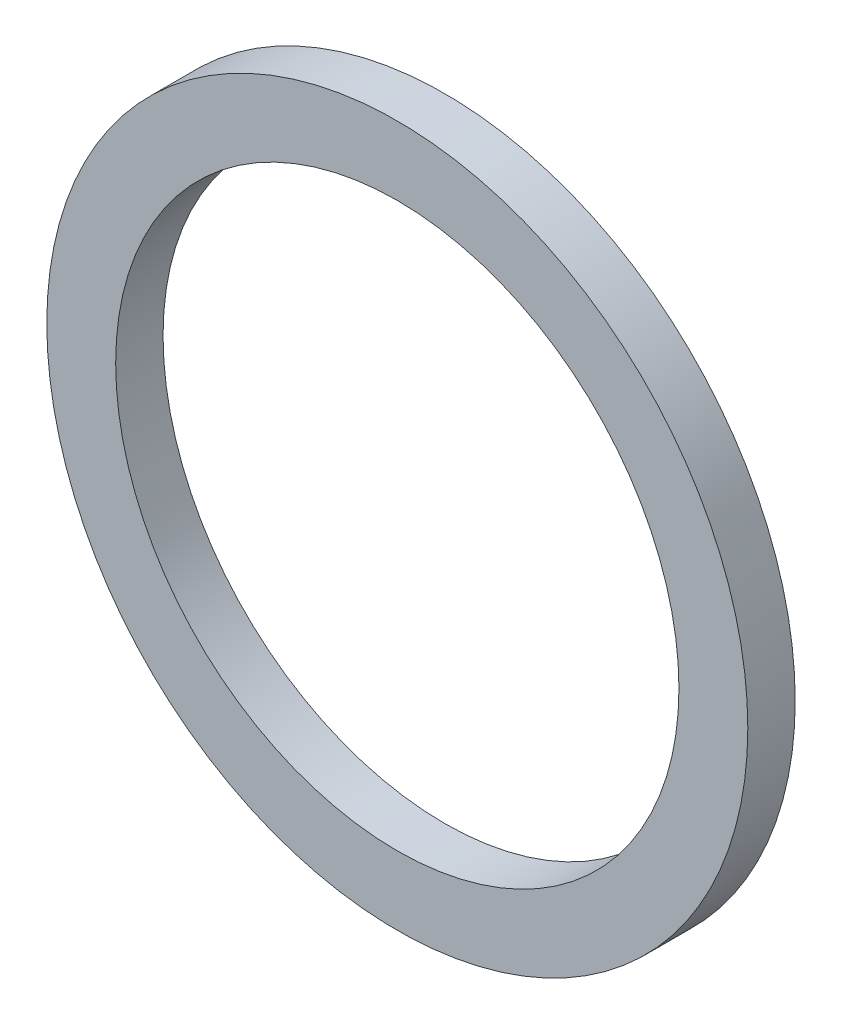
ISO-10303-21;
HEADER;
FILE_DESCRIPTION(('STEP AP214'),'2;1');
FILE_NAME('part.step','',(''),(''),'','','');
FILE_SCHEMA(('AUTOMOTIVE_DESIGN { 1 0 10303 214 1 1 1 1 }'));
ENDSEC;
DATA;
#1=APPLICATION_CONTEXT('core data for automotive mechanical design processes');
#2=APPLICATION_PROTOCOL_DEFINITION('international standard','automotive_design',2000,#1);
#3=PRODUCT_CONTEXT('',#1,'mechanical');
#4=PRODUCT('Part','Part','',(#3));
#5=PRODUCT_RELATED_PRODUCT_CATEGORY('part','',(#4));
#6=PRODUCT_DEFINITION_FORMATION('','',#4);
#7=PRODUCT_DEFINITION_CONTEXT('part definition',#1,'design');
#8=PRODUCT_DEFINITION('design','',#6,#7);
#9=PRODUCT_DEFINITION_SHAPE('','',#8);
#10=(LENGTH_UNIT() NAMED_UNIT(*) SI_UNIT(.MILLI.,.METRE.));
#11=(NAMED_UNIT(*) PLANE_ANGLE_UNIT() SI_UNIT($,.RADIAN.));
#12=(NAMED_UNIT(*) SI_UNIT($,.STERADIAN.) SOLID_ANGLE_UNIT());
#13=UNCERTAINTY_MEASURE_WITH_UNIT(LENGTH_MEASURE(1.E-05),#10,'distance_accuracy_value','');
#14=(GEOMETRIC_REPRESENTATION_CONTEXT(3) GLOBAL_UNCERTAINTY_ASSIGNED_CONTEXT((#13)) GLOBAL_UNIT_ASSIGNED_CONTEXT((#10,
#11,#12)) REPRESENTATION_CONTEXT('',''));
#15=CARTESIAN_POINT('',(0.,0.,0.));
#16=DIRECTION('',(0.,0.,1.));
#17=DIRECTION('',(1.,0.,0.));
#18=AXIS2_PLACEMENT_3D('',#15,#16,#17);
#19=CARTESIAN_POINT('',(0.,0.,1.49999999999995));
#20=DIRECTION('',(0.,0.,1.));
#21=DIRECTION('',(1.,0.,0.));
#22=AXIS2_PLACEMENT_3D('',#19,#20,#21);
#23=PLANE('',#22);
#24=CARTESIAN_POINT('',(0.,0.,1.49999999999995));
#25=DIRECTION('',(0.,0.,1.));
#26=DIRECTION('',(1.,0.,0.));
#27=AXIS2_PLACEMENT_3D('',#24,#25,#26);
#28=CIRCLE('',#27,11.095);
#29=CARTESIAN_POINT('',(11.095,0.,1.49999999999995));
#30=VERTEX_POINT('',#29);
#31=EDGE_CURVE('E10',#30,#30,#28,.T.);
#32=ORIENTED_EDGE('',*,*,#31,.T.);
#33=EDGE_LOOP('',(#32));
#34=FACE_BOUND('',#33,.T.);
#35=CARTESIAN_POINT('',(0.,0.,1.49999999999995));
#36=DIRECTION('',(0.,0.,1.));
#37=DIRECTION('',(1.,0.,0.));
#38=AXIS2_PLACEMENT_3D('',#35,#36,#37);
#39=CIRCLE('',#38,8.915);
#40=CARTESIAN_POINT('',(8.91500000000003,0.,1.49999999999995));
#41=VERTEX_POINT('',#40);
#42=EDGE_CURVE('E47',#41,#41,#39,.T.);
#43=ORIENTED_EDGE('',*,*,#42,.F.);
#44=EDGE_LOOP('',(#43));
#45=FACE_BOUND('',#44,.T.);
#46=ADVANCED_FACE('F36',(#34,#45),#23,.T.);
#47=CARTESIAN_POINT('',(0.,0.,0.));
#48=DIRECTION('',(0.,0.,1.));
#49=DIRECTION('',(1.,0.,0.));
#50=AXIS2_PLACEMENT_3D('',#47,#48,#49);
#51=PLANE('',#50);
#52=CARTESIAN_POINT('',(0.,0.,0.));
#53=DIRECTION('',(0.,0.,1.));
#54=DIRECTION('',(1.,0.,0.));
#55=AXIS2_PLACEMENT_3D('',#52,#53,#54);
#56=CIRCLE('',#55,11.095);
#57=CARTESIAN_POINT('',(11.095,0.,0.));
#58=VERTEX_POINT('',#57);
#59=EDGE_CURVE('E43',#58,#58,#56,.T.);
#60=ORIENTED_EDGE('',*,*,#59,.F.);
#61=EDGE_LOOP('',(#60));
#62=FACE_BOUND('',#61,.T.);
#63=CARTESIAN_POINT('',(0.,0.,0.));
#64=DIRECTION('',(0.,0.,1.));
#65=DIRECTION('',(1.,0.,0.));
#66=AXIS2_PLACEMENT_3D('',#63,#64,#65);
#67=CIRCLE('',#66,8.915);
#68=CARTESIAN_POINT('',(8.915,0.,0.));
#69=VERTEX_POINT('',#68);
#70=EDGE_CURVE('E51',#69,#69,#67,.T.);
#71=ORIENTED_EDGE('',*,*,#70,.T.);
#72=EDGE_LOOP('',(#71));
#73=FACE_BOUND('',#72,.T.);
#74=ADVANCED_FACE('F57',(#62,#73),#51,.F.);
#75=CARTESIAN_POINT('',(0.,0.,1.49999999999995));
#76=DIRECTION('',(0.,0.,-1.));
#77=DIRECTION('',(-1.,0.,0.));
#78=AXIS2_PLACEMENT_3D('',#75,#76,#77);
#79=CYLINDRICAL_SURFACE('',#78,11.095);
#80=ORIENTED_EDGE('',*,*,#31,.F.);
#81=EDGE_LOOP('',(#80));
#82=FACE_BOUND('',#81,.T.);
#83=ORIENTED_EDGE('',*,*,#59,.T.);
#84=EDGE_LOOP('',(#83));
#85=FACE_BOUND('',#84,.T.);
#86=ADVANCED_FACE('F38',(#82,#85),#79,.T.);
#87=CARTESIAN_POINT('',(0.,0.,1.49999999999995));
#88=DIRECTION('',(0.,0.,-1.));
#89=DIRECTION('',(-1.,0.,0.));
#90=AXIS2_PLACEMENT_3D('',#87,#88,#89);
#91=CYLINDRICAL_SURFACE('',#90,8.915);
#92=ORIENTED_EDGE('',*,*,#42,.T.);
#93=EDGE_LOOP('',(#92));
#94=FACE_BOUND('',#93,.T.);
#95=ORIENTED_EDGE('',*,*,#70,.F.);
#96=EDGE_LOOP('',(#95));
#97=FACE_BOUND('',#96,.T.);
#98=ADVANCED_FACE('F59',(#94,#97),#91,.F.);
#99=CLOSED_SHELL('',(#46,#74,#86,#98));
#100=MANIFOLD_SOLID_BREP('B2',#99);
#101=ADVANCED_BREP_SHAPE_REPRESENTATION('',(#18,#100),#14);
#102=SHAPE_DEFINITION_REPRESENTATION(#9,#101);
ENDSEC;
END-ISO-10303-21;
